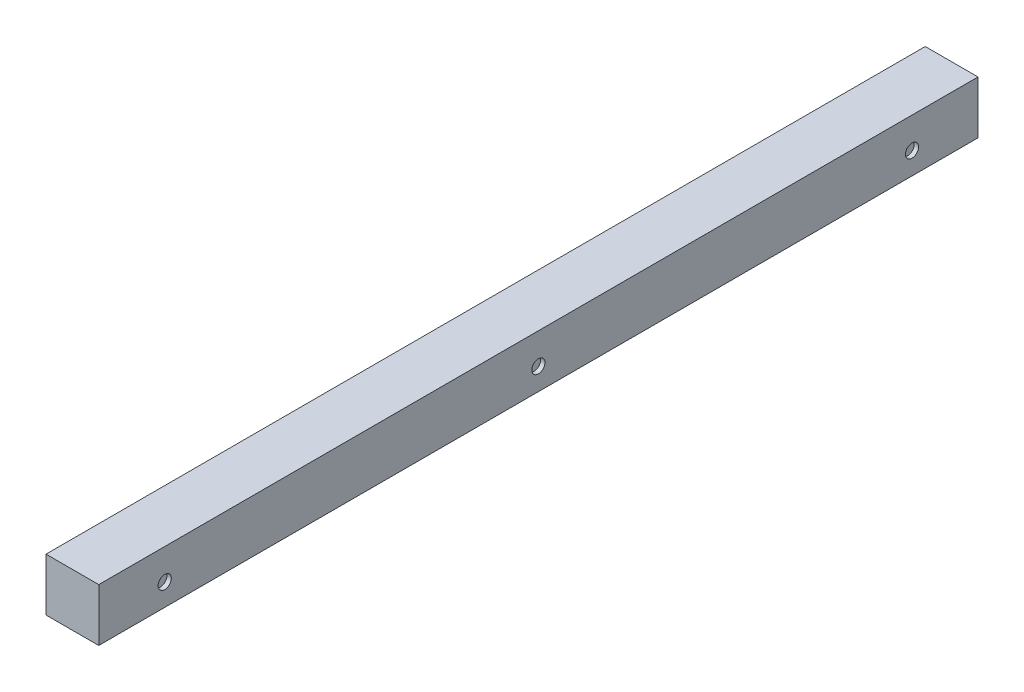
from build123d import *

# Parameters (mm, degrees)
ESQUISSE1_W                = 12
ESQUISSE1_H                = 12
EXTRUSION1_DEPTH           = 200
ESQUISSE3_R                = 1.5
ENL_V_MAT_EXTRU_2_DEPTH    = 1
R_P_TITION_LIN_AIRE1_COUNT = 3
R_P_TITION_LIN_AIRE1_PITCH = 85


with BuildPart() as part:
    # Esquisse1 → Extrusion1 (new body)
    with BuildSketch(Plane.XY):
        Rectangle(ESQUISSE1_W, ESQUISSE1_H)
    extrude(amount=-EXTRUSION1_DEPTH)

    # Esquisse3 → Enl_v. mat.-Extru.2 (cut)
    with BuildSketch(Plane(origin=(6, 0, 0), x_dir=(0, 0, -1), z_dir=(1, 0, 0))):
        with Locations(Location((15, -1, 0), (0, 0, 90))):
            Circle(ESQUISSE3_R)
    enl_v_mat_extru_2 = extrude(amount=-ENL_V_MAT_EXTRU_2_DEPTH, mode=Mode.SUBTRACT)

    # R_p_tition lin_aire1: Enl_v. mat.-Extru.2 ×3
    with Locations(*[(0, 0, -i * R_P_TITION_LIN_AIRE1_PITCH) for i in range(1, R_P_TITION_LIN_AIRE1_COUNT)]):
        add(enl_v_mat_extru_2, mode=Mode.SUBTRACT)


solid = part.part
